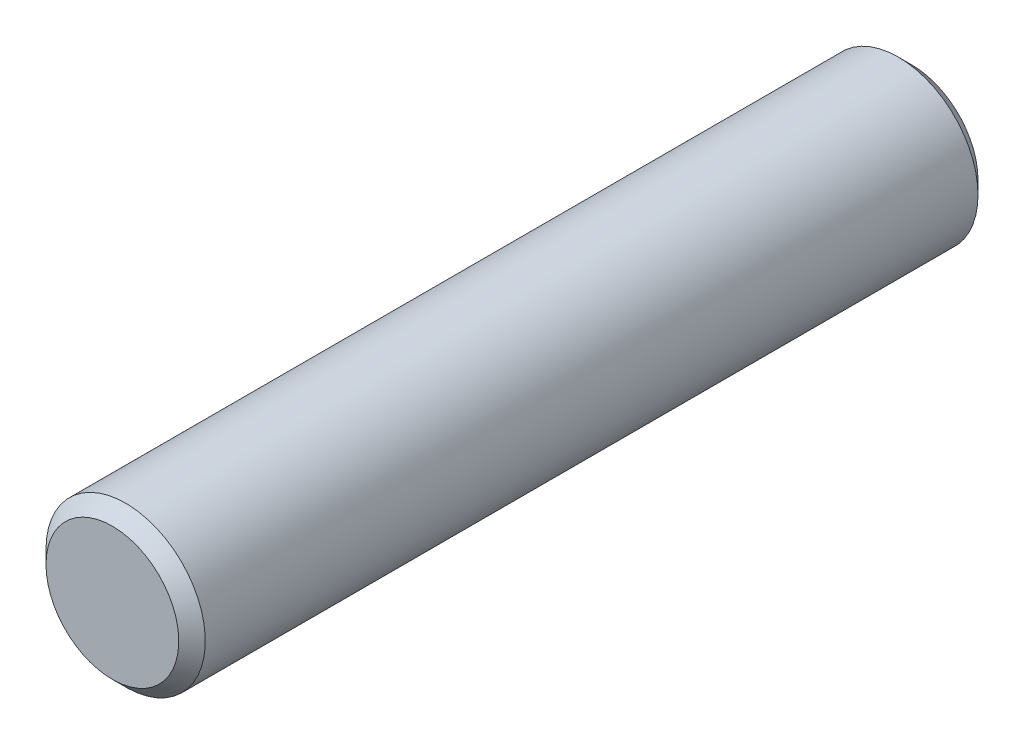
from build123d import *

# Parameters (mm, degrees)
BASE_EXTRUSION_DEPTH      = 11.65
BASE_EXTRUSION_DEPTH_BACK = 3.4
ESQUISSE1_R               = 1.5
CHANFREIN1_SIZE           = 0.25


with BuildPart() as part:
    # Esquisse1 → Base-Extrusion (new, two sides: drawn at the far end of the back side and taken through both)
    with BuildSketch(Plane.XY.offset(-BASE_EXTRUSION_DEPTH_BACK)):
        with Locations(Location((0, 15, 0), (0, 0, 180))):
            Circle(ESQUISSE1_R)
    extrude(amount=BASE_EXTRUSION_DEPTH + BASE_EXTRUSION_DEPTH_BACK)

    # Chanfrein1
    chanfrein1_edges = [part.edges().sort_by_distance(p)[0] for p in [
        (1.5, 15, 11.65),
        (1.5, 15, -3.4),
    ]]
    chamfer(chanfrein1_edges, length=CHANFREIN1_SIZE)


solid = part.part
